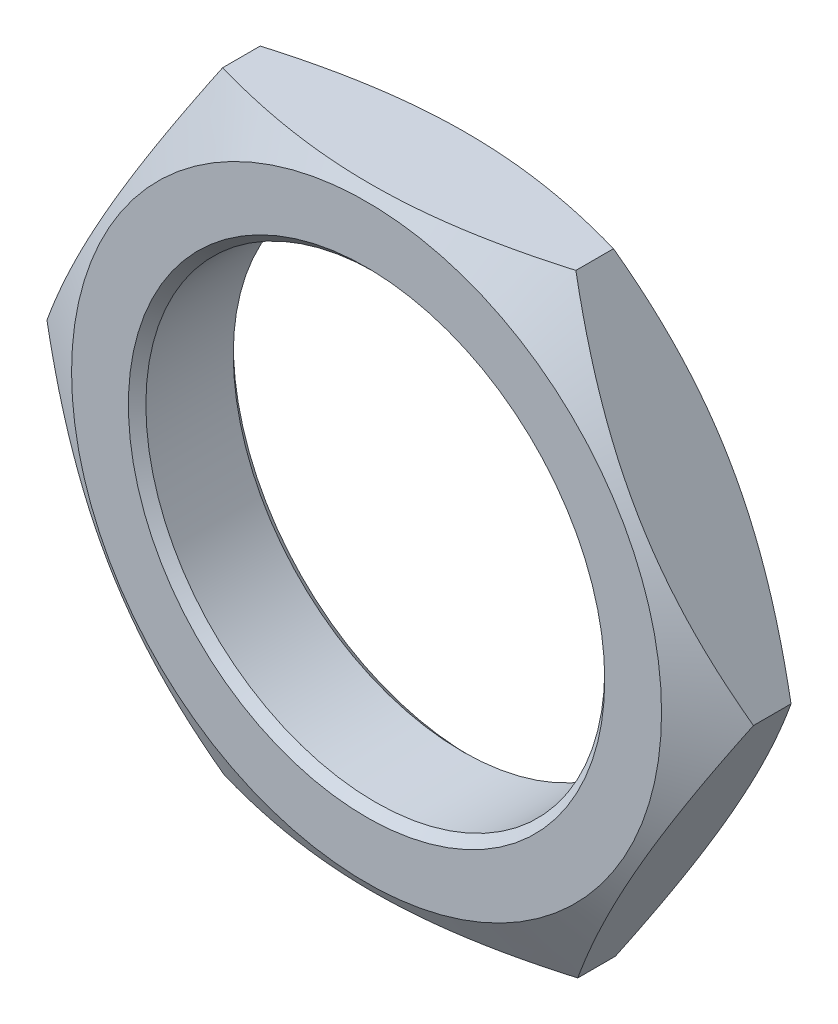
ISO-10303-21;
HEADER;
FILE_DESCRIPTION(('STEP AP214'),'2;1');
FILE_NAME('part.step','',(''),(''),'','','');
FILE_SCHEMA(('AUTOMOTIVE_DESIGN { 1 0 10303 214 1 1 1 1 }'));
ENDSEC;
DATA;
#1=APPLICATION_CONTEXT('core data for automotive mechanical design processes');
#2=APPLICATION_PROTOCOL_DEFINITION('international standard','automotive_design',2000,#1);
#3=PRODUCT_CONTEXT('',#1,'mechanical');
#4=PRODUCT('Part','Part','',(#3));
#5=PRODUCT_RELATED_PRODUCT_CATEGORY('part','',(#4));
#6=PRODUCT_DEFINITION_FORMATION('','',#4);
#7=PRODUCT_DEFINITION_CONTEXT('part definition',#1,'design');
#8=PRODUCT_DEFINITION('design','',#6,#7);
#9=PRODUCT_DEFINITION_SHAPE('','',#8);
#10=(LENGTH_UNIT() NAMED_UNIT(*) SI_UNIT(.MILLI.,.METRE.));
#11=(NAMED_UNIT(*) PLANE_ANGLE_UNIT() SI_UNIT($,.RADIAN.));
#12=(NAMED_UNIT(*) SI_UNIT($,.STERADIAN.) SOLID_ANGLE_UNIT());
#13=UNCERTAINTY_MEASURE_WITH_UNIT(LENGTH_MEASURE(1.E-05),#10,'distance_accuracy_value','');
#14=(GEOMETRIC_REPRESENTATION_CONTEXT(3) GLOBAL_UNCERTAINTY_ASSIGNED_CONTEXT((#13)) GLOBAL_UNIT_ASSIGNED_CONTEXT((#10,
#11,#12)) REPRESENTATION_CONTEXT('',''));
#15=CARTESIAN_POINT('',(0.,0.,0.));
#16=DIRECTION('',(0.,0.,1.));
#17=DIRECTION('',(1.,0.,0.));
#18=AXIS2_PLACEMENT_3D('',#15,#16,#17);
#19=CARTESIAN_POINT('',(-4.01970905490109,-7.01250828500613,2.4));
#20=DIRECTION('',(-0.00310333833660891,0.99999518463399,0.));
#21=DIRECTION('',(-0.99999518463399,-0.00310333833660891,0.));
#22=AXIS2_PLACEMENT_3D('',#19,#20,#21);
#23=PLANE('',#22);
#24=CARTESIAN_POINT('',(4.06335579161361,-6.98742367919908,0.769610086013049));
#25=CARTESIAN_POINT('',(3.88568555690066,-6.98797505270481,0.718328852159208));
#26=CARTESIAN_POINT('',(3.70735288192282,-6.9885284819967,0.669374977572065));
#27=CARTESIAN_POINT('',(3.34923928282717,-6.98963983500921,0.576762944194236));
#28=CARTESIAN_POINT('',(3.16945776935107,-6.99019776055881,0.533107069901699));
#29=CARTESIAN_POINT('',(2.62723473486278,-6.99188047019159,0.410943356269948));
#30=CARTESIAN_POINT('',(2.26265288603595,-6.99301189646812,0.341458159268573));
#31=CARTESIAN_POINT('',(1.7170627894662,-6.99470505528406,0.259978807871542));
#32=CARTESIAN_POINT('',(1.5376846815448,-6.9952617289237,0.236767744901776));
#33=CARTESIAN_POINT('',(1.17811796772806,-6.99637759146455,0.19784628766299));
#34=CARTESIAN_POINT('',(0.997929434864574,-6.9969367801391,0.1821352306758));
#35=CARTESIAN_POINT('',(0.63723943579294,-6.99805612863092,0.158614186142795));
#36=CARTESIAN_POINT('',(0.456738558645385,-6.99861628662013,0.150795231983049));
#37=CARTESIAN_POINT('',(0.0955800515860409,-6.99973708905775,0.143217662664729));
#38=CARTESIAN_POINT('',(-0.0850775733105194,-7.0002977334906,0.143458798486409));
#39=CARTESIAN_POINT('',(-0.580015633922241,-7.00183370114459,0.155198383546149));
#40=CARTESIAN_POINT('',(-0.894134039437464,-7.00280852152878,0.174904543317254));
#41=CARTESIAN_POINT('',(-1.52028451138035,-7.0047516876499,0.237391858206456));
#42=CARTESIAN_POINT('',(-1.83231437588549,-7.00572002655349,0.280194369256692));
#43=CARTESIAN_POINT('',(-2.4597248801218,-7.00766710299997,0.387187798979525));
#44=CARTESIAN_POINT('',(-2.77502635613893,-7.00864559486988,0.451832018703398));
#45=CARTESIAN_POINT('',(-3.40092738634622,-7.01058798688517,0.598548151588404));
#46=CARTESIAN_POINT('',(-3.71153495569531,-7.01155191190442,0.680585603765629));
#47=CARTESIAN_POINT('',(-4.01990905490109,-7.01250890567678,0.769610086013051));
#48=B_SPLINE_CURVE_WITH_KNOTS('',3,(#24,#25,#26,#27,#28,#29,#30,#31,#32,#33,#34,#35,#36,#37,#38,
#39,#40,#41,#42,#43,#44,#45,#46,#47),.UNSPECIFIED.,.F.,.F.,(4,2,2,2,2,2,2,2,2,2,2,4),(0.,
0.554726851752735,1.10969205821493,2.22192844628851,2.76442515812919,3.30687392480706,
3.8487056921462,4.39052071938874,5.3337433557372,6.27783963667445,7.24287417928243,
8.20601428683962),.UNSPECIFIED.);
#49=CARTESIAN_POINT('',(4.06315579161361,-6.98742429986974,0.769552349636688));
#50=VERTEX_POINT('',#49);
#51=CARTESIAN_POINT('',(-4.01970905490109,-7.01250828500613,0.76955234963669));
#52=VERTEX_POINT('',#51);
#53=EDGE_CURVE('E50',#50,#52,#48,.T.);
#54=ORIENTED_EDGE('',*,*,#53,.F.);
#55=DIRECTION('',(0.,0.,-1.));
#56=VECTOR('',#55,1.);
#57=CARTESIAN_POINT('',(4.06315579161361,-6.98742429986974,2.4));
#58=LINE('',#57,#56);
#59=CARTESIAN_POINT('',(4.06315579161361,-6.98742429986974,1.63044765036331));
#60=VERTEX_POINT('',#59);
#61=EDGE_CURVE('E120',#60,#50,#58,.T.);
#62=ORIENTED_EDGE('',*,*,#61,.F.);
#63=CARTESIAN_POINT('',(-4.01990905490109,-7.01250890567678,1.63038991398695));
#64=CARTESIAN_POINT('',(-3.84223882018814,-7.01195753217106,1.68167114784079));
#65=CARTESIAN_POINT('',(-3.6639061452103,-7.01140410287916,1.73062502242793));
#66=CARTESIAN_POINT('',(-3.30579254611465,-7.01029274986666,1.82323705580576));
#67=CARTESIAN_POINT('',(-3.12601103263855,-7.00973482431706,1.8668929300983));
#68=CARTESIAN_POINT('',(-2.58378799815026,-7.00805211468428,1.98905664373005));
#69=CARTESIAN_POINT('',(-2.21920614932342,-7.00692068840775,2.05854184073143));
#70=CARTESIAN_POINT('',(-1.67361605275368,-7.00522752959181,2.14002119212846));
#71=CARTESIAN_POINT('',(-1.49423794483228,-7.00467085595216,2.16323225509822));
#72=CARTESIAN_POINT('',(-1.13467123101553,-7.00355499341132,2.20215371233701));
#73=CARTESIAN_POINT('',(-0.954482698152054,-7.00299580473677,2.2178647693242));
#74=CARTESIAN_POINT('',(-0.593792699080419,-7.00187645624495,2.2413858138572));
#75=CARTESIAN_POINT('',(-0.413291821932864,-7.00131629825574,2.24920476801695));
#76=CARTESIAN_POINT('',(-0.0521333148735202,-7.00019549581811,2.25678233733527));
#77=CARTESIAN_POINT('',(0.12852431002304,-6.99963485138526,2.25654120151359));
#78=CARTESIAN_POINT('',(0.623462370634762,-6.99809888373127,2.24480161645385));
#79=CARTESIAN_POINT('',(0.937580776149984,-6.99712406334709,2.22509545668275));
#80=CARTESIAN_POINT('',(1.56373124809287,-6.99518089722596,2.16260814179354));
#81=CARTESIAN_POINT('',(1.87576111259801,-6.99421255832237,2.11980563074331));
#82=CARTESIAN_POINT('',(2.50317161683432,-6.9922654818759,2.01281220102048));
#83=CARTESIAN_POINT('',(2.81847309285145,-6.99128699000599,1.9481679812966));
#84=CARTESIAN_POINT('',(3.44437412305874,-6.98934459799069,1.8014518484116));
#85=CARTESIAN_POINT('',(3.75498169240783,-6.98838067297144,1.71941439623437));
#86=CARTESIAN_POINT('',(4.06335579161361,-6.98742367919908,1.63038991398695));
#87=B_SPLINE_CURVE_WITH_KNOTS('',3,(#63,#64,#65,#66,#67,#68,#69,#70,#71,#72,#73,#74,#75,#76,#77,
#78,#79,#80,#81,#82,#83,#84,#85,#86),.UNSPECIFIED.,.F.,.F.,(4,2,2,2,2,2,2,2,2,2,2,4),(0.,
0.554726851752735,1.10969205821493,2.22192844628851,2.76442515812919,3.30687392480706,
3.8487056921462,4.39052071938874,5.3337433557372,6.27783963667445,7.24287417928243,
8.20601428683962),.UNSPECIFIED.);
#88=CARTESIAN_POINT('',(-4.01970905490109,-7.01250828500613,1.63044765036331));
#89=VERTEX_POINT('',#88);
#90=EDGE_CURVE('E111',#89,#60,#87,.T.);
#91=ORIENTED_EDGE('',*,*,#90,.F.);
#92=DIRECTION('',(0.,0.,-1.));
#93=VECTOR('',#92,1.);
#94=CARTESIAN_POINT('',(-4.01970905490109,-7.01250828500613,2.4));
#95=LINE('',#94,#93);
#96=EDGE_CURVE('E107',#89,#52,#95,.T.);
#97=ORIENTED_EDGE('',*,*,#96,.T.);
#98=EDGE_LOOP('',(#54,#62,#91,#97));
#99=FACE_BOUND('',#98,.T.);
#100=ADVANCED_FACE('F35',(#99),#23,.F.);
#101=CARTESIAN_POINT('',(4.06315579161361,-6.98742429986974,2.4));
#102=DIRECTION('',(-0.86757290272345,0.497310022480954,0.));
#103=DIRECTION('',(-0.497310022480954,-0.86757290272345,0.));
#104=AXIS2_PLACEMENT_3D('',#101,#102,#103);
#105=PLANE('',#104);
#106=CARTESIAN_POINT('',(8.08297949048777,0.025283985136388,0.769618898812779));
#107=CARTESIAN_POINT('',(7.99462174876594,-0.128858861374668,0.718337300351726));
#108=CARTESIAN_POINT('',(7.90593456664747,-0.283576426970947,0.669383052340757));
#109=CARTESIAN_POINT('',(7.72783996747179,-0.5942680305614,0.576770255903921));
#110=CARTESIAN_POINT('',(7.63843225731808,-0.750242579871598,0.533113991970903));
#111=CARTESIAN_POINT('',(7.36877760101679,-1.22066356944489,0.410949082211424));
#112=CARTESIAN_POINT('',(7.18746623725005,-1.53696691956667,0.341463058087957));
#113=CARTESIAN_POINT('',(6.91613708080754,-2.01030912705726,0.259982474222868));
#114=CARTESIAN_POINT('',(6.82692998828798,-2.16593369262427,0.236771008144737));
#115=CARTESIAN_POINT('',(6.64811272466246,-2.47788600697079,0.19784874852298));
#116=CARTESIAN_POINT('',(6.55850258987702,-2.63421369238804,0.182137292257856));
#117=CARTESIAN_POINT('',(6.37912668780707,-2.94714056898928,0.158615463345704));
#118=CARTESIAN_POINT('',(6.28936121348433,-3.10373924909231,0.150796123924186));
#119=CARTESIAN_POINT('',(6.10975230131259,-3.41707261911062,0.143217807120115));
#120=CARTESIAN_POINT('',(6.01990886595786,-3.57380730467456,0.143458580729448));
#121=CARTESIAN_POINT('',(5.77376761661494,-4.00320841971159,0.155197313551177));
#122=CARTESIAN_POINT('',(5.61755037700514,-4.27573428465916,0.174903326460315));
#123=CARTESIAN_POINT('',(5.30615347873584,-4.81897592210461,0.237391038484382));
#124=CARTESIAN_POINT('',(5.15097491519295,-5.08968978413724,0.280194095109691));
#125=CARTESIAN_POINT('',(4.83895134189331,-5.63402467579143,0.38718922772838));
#126=CARTESIAN_POINT('',(4.68214570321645,-5.90757702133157,0.451834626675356));
#127=CARTESIAN_POINT('',(4.37087282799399,-6.45060229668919,0.598553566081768));
#128=CARTESIAN_POINT('',(4.21640160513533,-6.7200821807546,0.680592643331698));
#129=CARTESIAN_POINT('',(4.06304114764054,-6.98762429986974,0.769618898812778));
#130=B_SPLINE_CURVE_WITH_KNOTS('',3,(#106,#107,#108,#109,#110,#111,#112,#113,#114,#115,#116,
#117,#118,#119,#120,#121,#122,#123,#124,#125,#126,#127,#128,#129),.UNSPECIFIED.,.F.,.F.,(4,2,2,
2,2,2,2,2,2,2,2,4),(0.,0.554727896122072,1.10969414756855,2.22193268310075,2.76443034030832,
3.30688005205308,3.84871275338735,4.39052871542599,5.33376486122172,6.27787470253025,
7.24292352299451,8.20607780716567),.UNSPECIFIED.);
#131=CARTESIAN_POINT('',(8.0828648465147,0.0250839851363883,0.76955234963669));
#132=VERTEX_POINT('',#131);
#133=EDGE_CURVE('E184',#132,#50,#130,.T.);
#134=ORIENTED_EDGE('',*,*,#133,.F.);
#135=DIRECTION('',(0.,0.,-1.));
#136=VECTOR('',#135,1.);
#137=CARTESIAN_POINT('',(8.0828648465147,0.0250839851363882,2.4));
#138=LINE('',#137,#136);
#139=CARTESIAN_POINT('',(8.0828648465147,0.0250839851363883,1.63044765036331));
#140=VERTEX_POINT('',#139);
#141=EDGE_CURVE('E117',#140,#132,#138,.T.);
#142=ORIENTED_EDGE('',*,*,#141,.F.);
#143=CARTESIAN_POINT('',(4.06304114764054,-6.98762429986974,1.63038110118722));
#144=CARTESIAN_POINT('',(4.15139888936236,-6.83348145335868,1.68166269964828));
#145=CARTESIAN_POINT('',(4.24008607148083,-6.6787638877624,1.73061694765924));
#146=CARTESIAN_POINT('',(4.41818067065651,-6.36807228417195,1.82322974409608));
#147=CARTESIAN_POINT('',(4.50758838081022,-6.21209773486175,1.8668860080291));
#148=CARTESIAN_POINT('',(4.77724303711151,-5.74167674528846,1.98905091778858));
#149=CARTESIAN_POINT('',(4.95855440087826,-5.42537339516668,2.05853694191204));
#150=CARTESIAN_POINT('',(5.22988355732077,-4.95203118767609,2.14001752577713));
#151=CARTESIAN_POINT('',(5.31909064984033,-4.79640662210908,2.16322899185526));
#152=CARTESIAN_POINT('',(5.49790791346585,-4.48445430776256,2.20215125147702));
#153=CARTESIAN_POINT('',(5.58751804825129,-4.32812662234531,2.21786270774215));
#154=CARTESIAN_POINT('',(5.76689395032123,-4.01519974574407,2.2413845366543));
#155=CARTESIAN_POINT('',(5.85665942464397,-3.85860106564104,2.24920387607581));
#156=CARTESIAN_POINT('',(6.03626833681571,-3.54526769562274,2.25678219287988));
#157=CARTESIAN_POINT('',(6.12611177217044,-3.38853301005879,2.25654141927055));
#158=CARTESIAN_POINT('',(6.37225302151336,-2.95913189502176,2.24480268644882));
#159=CARTESIAN_POINT('',(6.52847026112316,-2.68660603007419,2.22509667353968));
#160=CARTESIAN_POINT('',(6.83986715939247,-2.14336439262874,2.16260896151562));
#161=CARTESIAN_POINT('',(6.99504572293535,-1.87265053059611,2.11980590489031));
#162=CARTESIAN_POINT('',(7.30706929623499,-1.32831563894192,2.01281077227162));
#163=CARTESIAN_POINT('',(7.46387493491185,-1.05476329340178,1.94816537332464));
#164=CARTESIAN_POINT('',(7.77514781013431,-0.511738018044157,1.80144643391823));
#165=CARTESIAN_POINT('',(7.92961903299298,-0.24225813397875,1.7194073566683));
#166=CARTESIAN_POINT('',(8.08297949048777,0.0252839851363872,1.63038110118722));
#167=B_SPLINE_CURVE_WITH_KNOTS('',3,(#143,#144,#145,#146,#147,#148,#149,#150,#151,#152,#153,
#154,#155,#156,#157,#158,#159,#160,#161,#162,#163,#164,#165,#166),.UNSPECIFIED.,.F.,.F.,(4,2,2,
2,2,2,2,2,2,2,2,4),(0.,0.554727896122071,1.10969414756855,2.22193268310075,2.76443034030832,
3.30688005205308,3.84871275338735,4.39052871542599,5.33376486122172,6.27787470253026,
7.24292352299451,8.20607780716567),.UNSPECIFIED.);
#168=EDGE_CURVE('E166',#60,#140,#167,.T.);
#169=ORIENTED_EDGE('',*,*,#168,.F.);
#170=ORIENTED_EDGE('',*,*,#61,.T.);
#171=EDGE_LOOP('',(#134,#142,#169,#170));
#172=FACE_BOUND('',#171,.T.);
#173=ADVANCED_FACE('F175',(#172),#105,.F.);
#174=CARTESIAN_POINT('',(8.0828648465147,0.0250839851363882,2.4));
#175=DIRECTION('',(-0.864469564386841,-0.502685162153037,0.));
#176=DIRECTION('',(0.502685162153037,-0.864469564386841,0.));
#177=AXIS2_PLACEMENT_3D('',#174,#175,#176);
#178=PLANE('',#177);
#179=CARTESIAN_POINT('',(4.01959275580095,7.01270828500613,0.769619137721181));
#180=CARTESIAN_POINT('',(4.10890550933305,6.85911680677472,0.718337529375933));
#181=CARTESIAN_POINT('',(4.19855126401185,6.70495266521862,0.669383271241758));
#182=CARTESIAN_POINT('',(4.37857079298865,6.39537240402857,0.576770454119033));
#183=CARTESIAN_POINT('',(4.4689448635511,6.23995577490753,0.53311417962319));
#184=CARTESIAN_POINT('',(4.74151407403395,5.77121747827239,0.410949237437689));
#185=CARTESIAN_POINT('',(4.92478513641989,5.45604554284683,0.341463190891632));
#186=CARTESIAN_POINT('',(5.19904694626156,4.984396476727,0.259982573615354));
#187=CARTESIAN_POINT('',(5.2892182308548,4.82932857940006,0.236771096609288));
#188=CARTESIAN_POINT('',(5.46996823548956,4.51849211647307,0.197848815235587));
#189=CARTESIAN_POINT('',(5.56054691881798,4.36272361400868,0.182137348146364));
#190=CARTESIAN_POINT('',(5.74186160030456,4.05091607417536,0.15861549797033));
#191=CARTESIAN_POINT('',(5.83259730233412,3.89487754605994,0.150796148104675));
#192=CARTESIAN_POINT('',(6.01414751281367,3.5826649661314,0.143217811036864));
#193=CARTESIAN_POINT('',(6.10496201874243,3.42649091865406,0.143458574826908));
#194=CARTESIAN_POINT('',(6.35376373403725,2.9986256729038,0.155197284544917));
#195=CARTESIAN_POINT('',(6.51166949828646,2.72707453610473,0.174903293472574));
#196=CARTESIAN_POINT('',(6.82643223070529,2.18577588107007,0.237391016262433));
#197=CARTESIAN_POINT('',(6.98328809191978,1.91603026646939,0.280194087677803));
#198=CARTESIAN_POINT('',(7.29868427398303,1.37364226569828,0.387189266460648));
#199=CARTESIAN_POINT('',(7.45718479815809,1.10106831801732,0.451834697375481));
#200=CARTESIAN_POINT('',(7.77182216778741,0.559985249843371,0.598553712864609));
#201=CARTESIAN_POINT('',(7.92796304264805,0.291469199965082,0.680592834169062));
#202=CARTESIAN_POINT('',(8.08298114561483,0.0248839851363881,0.769619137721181));
#203=B_SPLINE_CURVE_WITH_KNOTS('',3,(#179,#180,#181,#182,#183,#184,#185,#186,#187,#188,#189,
#190,#191,#192,#193,#194,#195,#196,#197,#198,#199,#200,#201,#202),.UNSPECIFIED.,.F.,.F.,(4,2,2,
2,2,2,2,2,2,2,2,4),(0.,0.554727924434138,1.10969420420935,2.22193279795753,2.7644304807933,
3.30688021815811,3.8487129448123,4.39052893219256,5.33376544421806,6.2778756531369,
7.24292486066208,8.20607952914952),.UNSPECIFIED.);
#204=CARTESIAN_POINT('',(4.01970905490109,7.01250828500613,0.769552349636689));
#205=VERTEX_POINT('',#204);
#206=EDGE_CURVE('E190',#205,#132,#203,.T.);
#207=ORIENTED_EDGE('',*,*,#206,.F.);
#208=DIRECTION('',(0.,0.,-1.));
#209=VECTOR('',#208,1.);
#210=CARTESIAN_POINT('',(4.01970905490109,7.01250828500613,2.4));
#211=LINE('',#210,#209);
#212=CARTESIAN_POINT('',(4.01970905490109,7.01250828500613,1.63044765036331));
#213=VERTEX_POINT('',#212);
#214=EDGE_CURVE('E109',#213,#205,#211,.T.);
#215=ORIENTED_EDGE('',*,*,#214,.F.);
#216=CARTESIAN_POINT('',(8.08298114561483,0.0248839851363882,1.63038086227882));
#217=CARTESIAN_POINT('',(7.99366839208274,0.178475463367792,1.68166247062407));
#218=CARTESIAN_POINT('',(7.90402263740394,0.332639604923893,1.73061672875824));
#219=CARTESIAN_POINT('',(7.72400310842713,0.642219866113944,1.82322954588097));
#220=CARTESIAN_POINT('',(7.63362903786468,0.797636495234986,1.86688582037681));
#221=CARTESIAN_POINT('',(7.36105982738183,1.26637479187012,1.98905076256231));
#222=CARTESIAN_POINT('',(7.1777887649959,1.58154672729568,2.05853680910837));
#223=CARTESIAN_POINT('',(6.90352695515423,2.05319579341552,2.14001742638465));
#224=CARTESIAN_POINT('',(6.81335567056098,2.20826369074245,2.16322890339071));
#225=CARTESIAN_POINT('',(6.63260566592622,2.51910015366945,2.20215118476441));
#226=CARTESIAN_POINT('',(6.54202698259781,2.67486865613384,2.21786265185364));
#227=CARTESIAN_POINT('',(6.36071230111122,2.98667619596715,2.24138450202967));
#228=CARTESIAN_POINT('',(6.26997659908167,3.14271472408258,2.24920385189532));
#229=CARTESIAN_POINT('',(6.08842638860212,3.45492730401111,2.25678218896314));
#230=CARTESIAN_POINT('',(5.99761188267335,3.61110135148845,2.25654142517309));
#231=CARTESIAN_POINT('',(5.74881016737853,4.03896659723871,2.24480271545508));
#232=CARTESIAN_POINT('',(5.59090440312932,4.31051773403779,2.22509670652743));
#233=CARTESIAN_POINT('',(5.27614167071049,4.85181638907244,2.16260898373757));
#234=CARTESIAN_POINT('',(5.119285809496,5.12156200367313,2.1198059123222));
#235=CARTESIAN_POINT('',(4.80388962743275,5.66395000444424,2.01281073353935));
#236=CARTESIAN_POINT('',(4.6453891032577,5.9365239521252,1.94816530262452));
#237=CARTESIAN_POINT('',(4.33075173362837,6.47760702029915,1.80144628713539));
#238=CARTESIAN_POINT('',(4.17461085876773,6.74612307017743,1.71940716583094));
#239=CARTESIAN_POINT('',(4.01959275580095,7.01270828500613,1.63038086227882));
#240=B_SPLINE_CURVE_WITH_KNOTS('',3,(#216,#217,#218,#219,#220,#221,#222,#223,#224,#225,#226,
#227,#228,#229,#230,#231,#232,#233,#234,#235,#236,#237,#238,#239),.UNSPECIFIED.,.F.,.F.,(4,2,2,
2,2,2,2,2,2,2,2,4),(0.,0.554727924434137,1.10969420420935,2.22193279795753,2.76443048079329,
3.30688021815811,3.8487129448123,4.39052893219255,5.33376544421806,6.2778756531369,
7.24292486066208,8.20607952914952),.UNSPECIFIED.);
#241=EDGE_CURVE('E160',#140,#213,#240,.T.);
#242=ORIENTED_EDGE('',*,*,#241,.F.);
#243=ORIENTED_EDGE('',*,*,#141,.T.);
#244=EDGE_LOOP('',(#207,#215,#242,#243));
#245=FACE_BOUND('',#244,.T.);
#246=ADVANCED_FACE('F178',(#245),#178,.F.);
#247=CARTESIAN_POINT('',(4.01970905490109,7.01250828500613,2.4));
#248=DIRECTION('',(0.00310333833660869,-0.99999518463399,0.));
#249=DIRECTION('',(0.99999518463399,0.00310333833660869,0.));
#250=AXIS2_PLACEMENT_3D('',#247,#248,#249);
#251=PLANE('',#250);
#252=CARTESIAN_POINT('',(-4.06335579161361,6.98742367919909,0.769610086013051));
#253=CARTESIAN_POINT('',(-3.88568555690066,6.98797505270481,0.71832885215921));
#254=CARTESIAN_POINT('',(-3.70735288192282,6.9885284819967,0.669374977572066));
#255=CARTESIAN_POINT('',(-3.34923928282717,6.98963983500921,0.576762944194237));
#256=CARTESIAN_POINT('',(-3.16945776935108,6.99019776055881,0.5331070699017));
#257=CARTESIAN_POINT('',(-2.62723473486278,6.99188047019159,0.410943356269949));
#258=CARTESIAN_POINT('',(-2.26265288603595,6.99301189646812,0.341458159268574));
#259=CARTESIAN_POINT('',(-1.7170627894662,6.99470505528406,0.259978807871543));
#260=CARTESIAN_POINT('',(-1.5376846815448,6.99526172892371,0.236767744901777));
#261=CARTESIAN_POINT('',(-1.17811796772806,6.99637759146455,0.197846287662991));
#262=CARTESIAN_POINT('',(-0.997929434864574,6.9969367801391,0.182135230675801));
#263=CARTESIAN_POINT('',(-0.637239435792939,6.99805612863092,0.158614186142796));
#264=CARTESIAN_POINT('',(-0.456738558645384,6.99861628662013,0.150795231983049));
#265=CARTESIAN_POINT('',(-0.0955800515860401,6.99973708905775,0.14321766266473));
#266=CARTESIAN_POINT('',(0.0850775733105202,7.0002977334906,0.14345879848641));
#267=CARTESIAN_POINT('',(0.580015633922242,7.00183370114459,0.15519838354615));
#268=CARTESIAN_POINT('',(0.894134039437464,7.00280852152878,0.174904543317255));
#269=CARTESIAN_POINT('',(1.52028451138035,7.0047516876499,0.237391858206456));
#270=CARTESIAN_POINT('',(1.83231437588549,7.00572002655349,0.280194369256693));
#271=CARTESIAN_POINT('',(2.4597248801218,7.00766710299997,0.387187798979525));
#272=CARTESIAN_POINT('',(2.77502635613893,7.00864559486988,0.451832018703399));
#273=CARTESIAN_POINT('',(3.40092738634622,7.01058798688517,0.598548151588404));
#274=CARTESIAN_POINT('',(3.71153495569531,7.01155191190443,0.680585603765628));
#275=CARTESIAN_POINT('',(4.01990905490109,7.01250890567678,0.769610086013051));
#276=B_SPLINE_CURVE_WITH_KNOTS('',3,(#252,#253,#254,#255,#256,#257,#258,#259,#260,#261,#262,
#263,#264,#265,#266,#267,#268,#269,#270,#271,#272,#273,#274,#275),.UNSPECIFIED.,.F.,.F.,(4,2,2,
2,2,2,2,2,2,2,2,4),(0.,0.554726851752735,1.10969205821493,2.22192844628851,2.76442515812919,
3.30687392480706,3.84870569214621,4.39052071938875,5.3337433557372,6.27783963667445,
7.24287417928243,8.20601428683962),.UNSPECIFIED.);
#277=CARTESIAN_POINT('',(-4.06315579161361,6.98742429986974,0.76955234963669));
#278=VERTEX_POINT('',#277);
#279=EDGE_CURVE('E103',#278,#205,#276,.T.);
#280=ORIENTED_EDGE('',*,*,#279,.F.);
#281=DIRECTION('',(0.,0.,-1.));
#282=VECTOR('',#281,1.);
#283=CARTESIAN_POINT('',(-4.06315579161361,6.98742429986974,2.4));
#284=LINE('',#283,#282);
#285=CARTESIAN_POINT('',(-4.06315579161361,6.98742429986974,1.63044765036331));
#286=VERTEX_POINT('',#285);
#287=EDGE_CURVE('E102',#286,#278,#284,.T.);
#288=ORIENTED_EDGE('',*,*,#287,.F.);
#289=CARTESIAN_POINT('',(4.01990905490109,7.01250890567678,1.63038991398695));
#290=CARTESIAN_POINT('',(3.84223882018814,7.01195753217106,1.68167114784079));
#291=CARTESIAN_POINT('',(3.6639061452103,7.01140410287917,1.73062502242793));
#292=CARTESIAN_POINT('',(3.30579254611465,7.01029274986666,1.82323705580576));
#293=CARTESIAN_POINT('',(3.12601103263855,7.00973482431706,1.8668929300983));
#294=CARTESIAN_POINT('',(2.58378799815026,7.00805211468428,1.98905664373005));
#295=CARTESIAN_POINT('',(2.21920614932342,7.00692068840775,2.05854184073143));
#296=CARTESIAN_POINT('',(1.67361605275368,7.00522752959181,2.14002119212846));
#297=CARTESIAN_POINT('',(1.49423794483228,7.00467085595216,2.16323225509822));
#298=CARTESIAN_POINT('',(1.13467123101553,7.00355499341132,2.20215371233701));
#299=CARTESIAN_POINT('',(0.954482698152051,7.00299580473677,2.2178647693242));
#300=CARTESIAN_POINT('',(0.593792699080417,7.00187645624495,2.2413858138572));
#301=CARTESIAN_POINT('',(0.413291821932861,7.00131629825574,2.24920476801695));
#302=CARTESIAN_POINT('',(0.0521333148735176,7.00019549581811,2.25678233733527));
#303=CARTESIAN_POINT('',(-0.128524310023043,6.99963485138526,2.25654120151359));
#304=CARTESIAN_POINT('',(-0.623462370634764,6.99809888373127,2.24480161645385));
#305=CARTESIAN_POINT('',(-0.937580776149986,6.99712406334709,2.22509545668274));
#306=CARTESIAN_POINT('',(-1.56373124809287,6.99518089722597,2.16260814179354));
#307=CARTESIAN_POINT('',(-1.87576111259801,6.99421255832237,2.11980563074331));
#308=CARTESIAN_POINT('',(-2.50317161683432,6.9922654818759,2.01281220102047));
#309=CARTESIAN_POINT('',(-2.81847309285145,6.99128699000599,1.9481679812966));
#310=CARTESIAN_POINT('',(-3.44437412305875,6.9893445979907,1.80145184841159));
#311=CARTESIAN_POINT('',(-3.75498169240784,6.98838067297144,1.71941439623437));
#312=CARTESIAN_POINT('',(-4.06335579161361,6.98742367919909,1.63038991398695));
#313=B_SPLINE_CURVE_WITH_KNOTS('',3,(#289,#290,#291,#292,#293,#294,#295,#296,#297,#298,#299,
#300,#301,#302,#303,#304,#305,#306,#307,#308,#309,#310,#311,#312),.UNSPECIFIED.,.F.,.F.,(4,2,2,
2,2,2,2,2,2,2,2,4),(0.,0.554726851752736,1.10969205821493,2.22192844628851,2.76442515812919,
3.30687392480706,3.84870569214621,4.39052071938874,5.3337433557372,6.27783963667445,
7.24287417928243,8.20601428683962),.UNSPECIFIED.);
#314=EDGE_CURVE('E154',#213,#286,#313,.T.);
#315=ORIENTED_EDGE('',*,*,#314,.F.);
#316=ORIENTED_EDGE('',*,*,#214,.T.);
#317=EDGE_LOOP('',(#280,#288,#315,#316));
#318=FACE_BOUND('',#317,.T.);
#319=ADVANCED_FACE('F209',(#318),#251,.F.);
#320=CARTESIAN_POINT('',(-4.06315579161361,6.98742429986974,2.4));
#321=DIRECTION('',(0.86757290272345,-0.497310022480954,0.));
#322=DIRECTION('',(0.497310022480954,0.86757290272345,0.));
#323=AXIS2_PLACEMENT_3D('',#320,#321,#322);
#324=PLANE('',#323);
#325=CARTESIAN_POINT('',(-8.08297949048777,-0.0252839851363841,0.76961889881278));
#326=CARTESIAN_POINT('',(-7.99462174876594,0.128858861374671,0.718337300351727));
#327=CARTESIAN_POINT('',(-7.90593456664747,0.28357642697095,0.669383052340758));
#328=CARTESIAN_POINT('',(-7.7278399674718,0.594268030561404,0.576770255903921));
#329=CARTESIAN_POINT('',(-7.63843225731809,0.750242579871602,0.533113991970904));
#330=CARTESIAN_POINT('',(-7.3687776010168,1.22066356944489,0.410949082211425));
#331=CARTESIAN_POINT('',(-7.18746623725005,1.53696691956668,0.341463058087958));
#332=CARTESIAN_POINT('',(-6.91613708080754,2.01030912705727,0.25998247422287));
#333=CARTESIAN_POINT('',(-6.82692998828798,2.16593369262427,0.236771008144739));
#334=CARTESIAN_POINT('',(-6.64811272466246,2.4778860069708,0.197848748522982));
#335=CARTESIAN_POINT('',(-6.55850258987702,2.63421369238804,0.182137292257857));
#336=CARTESIAN_POINT('',(-6.37912668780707,2.94714056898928,0.158615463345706));
#337=CARTESIAN_POINT('',(-6.28936121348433,3.10373924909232,0.150796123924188));
#338=CARTESIAN_POINT('',(-6.10975230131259,3.41707261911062,0.143217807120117));
#339=CARTESIAN_POINT('',(-6.01990886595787,3.57380730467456,0.14345858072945));
#340=CARTESIAN_POINT('',(-5.77376761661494,4.0032084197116,0.155197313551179));
#341=CARTESIAN_POINT('',(-5.61755037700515,4.27573428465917,0.174903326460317));
#342=CARTESIAN_POINT('',(-5.30615347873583,4.81897592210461,0.237391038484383));
#343=CARTESIAN_POINT('',(-5.15097491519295,5.08968978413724,0.280194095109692));
#344=CARTESIAN_POINT('',(-4.83895134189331,5.63402467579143,0.387189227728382));
#345=CARTESIAN_POINT('',(-4.68214570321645,5.90757702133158,0.451834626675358));
#346=CARTESIAN_POINT('',(-4.37087282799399,6.4506022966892,0.598553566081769));
#347=CARTESIAN_POINT('',(-4.21640160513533,6.7200821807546,0.6805926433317));
#348=CARTESIAN_POINT('',(-4.06304114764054,6.98762429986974,0.769618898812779));
#349=B_SPLINE_CURVE_WITH_KNOTS('',3,(#325,#326,#327,#328,#329,#330,#331,#332,#333,#334,#335,
#336,#337,#338,#339,#340,#341,#342,#343,#344,#345,#346,#347,#348),.UNSPECIFIED.,.F.,.F.,(4,2,2,
2,2,2,2,2,2,2,2,4),(0.,0.554727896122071,1.10969414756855,2.22193268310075,2.76443034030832,
3.30688005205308,3.84871275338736,4.39052871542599,5.33376486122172,6.27787470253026,
7.24292352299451,8.20607780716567),.UNSPECIFIED.);
#350=CARTESIAN_POINT('',(-8.0828648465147,-0.0250839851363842,0.769552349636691));
#351=VERTEX_POINT('',#350);
#352=EDGE_CURVE('E88',#351,#278,#349,.T.);
#353=ORIENTED_EDGE('',*,*,#352,.F.);
#354=DIRECTION('',(0.,0.,-1.));
#355=VECTOR('',#354,1.);
#356=CARTESIAN_POINT('',(-8.0828648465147,-0.0250839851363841,2.4));
#357=LINE('',#356,#355);
#358=CARTESIAN_POINT('',(-8.0828648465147,-0.0250839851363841,1.63044765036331));
#359=VERTEX_POINT('',#358);
#360=EDGE_CURVE('E100',#359,#351,#357,.T.);
#361=ORIENTED_EDGE('',*,*,#360,.F.);
#362=CARTESIAN_POINT('',(-4.06304114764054,6.98762429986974,1.63038110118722));
#363=CARTESIAN_POINT('',(-4.15139888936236,6.83348145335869,1.68166269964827));
#364=CARTESIAN_POINT('',(-4.24008607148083,6.67876388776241,1.73061694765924));
#365=CARTESIAN_POINT('',(-4.41818067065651,6.36807228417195,1.82322974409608));
#366=CARTESIAN_POINT('',(-4.50758838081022,6.21209773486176,1.8668860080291));
#367=CARTESIAN_POINT('',(-4.77724303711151,5.74167674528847,1.98905091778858));
#368=CARTESIAN_POINT('',(-4.95855440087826,5.42537339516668,2.05853694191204));
#369=CARTESIAN_POINT('',(-5.22988355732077,4.95203118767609,2.14001752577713));
#370=CARTESIAN_POINT('',(-5.31909064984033,4.79640662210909,2.16322899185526));
#371=CARTESIAN_POINT('',(-5.49790791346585,4.48445430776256,2.20215125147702));
#372=CARTESIAN_POINT('',(-5.58751804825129,4.32812662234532,2.21786270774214));
#373=CARTESIAN_POINT('',(-5.76689395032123,4.01519974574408,2.24138453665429));
#374=CARTESIAN_POINT('',(-5.85665942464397,3.85860106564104,2.24920387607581));
#375=CARTESIAN_POINT('',(-6.03626833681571,3.54526769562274,2.25678219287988));
#376=CARTESIAN_POINT('',(-6.12611177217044,3.3885330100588,2.25654141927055));
#377=CARTESIAN_POINT('',(-6.37225302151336,2.95913189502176,2.24480268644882));
#378=CARTESIAN_POINT('',(-6.52847026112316,2.68660603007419,2.22509667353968));
#379=CARTESIAN_POINT('',(-6.83986715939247,2.14336439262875,2.16260896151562));
#380=CARTESIAN_POINT('',(-6.99504572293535,1.87265053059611,2.11980590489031));
#381=CARTESIAN_POINT('',(-7.30706929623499,1.32831563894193,2.01281077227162));
#382=CARTESIAN_POINT('',(-7.46387493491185,1.05476329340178,1.94816537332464));
#383=CARTESIAN_POINT('',(-7.77514781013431,0.511738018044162,1.80144643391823));
#384=CARTESIAN_POINT('',(-7.92961903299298,0.242258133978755,1.7194073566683));
#385=CARTESIAN_POINT('',(-8.08297949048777,-0.0252839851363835,1.63038110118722));
#386=B_SPLINE_CURVE_WITH_KNOTS('',3,(#362,#363,#364,#365,#366,#367,#368,#369,#370,#371,#372,
#373,#374,#375,#376,#377,#378,#379,#380,#381,#382,#383,#384,#385),.UNSPECIFIED.,.F.,.F.,(4,2,2,
2,2,2,2,2,2,2,2,4),(0.,0.554727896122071,1.10969414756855,2.22193268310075,2.76443034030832,
3.30688005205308,3.84871275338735,4.39052871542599,5.33376486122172,6.27787470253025,
7.24292352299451,8.20607780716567),.UNSPECIFIED.);
#387=EDGE_CURVE('E58',#286,#359,#386,.T.);
#388=ORIENTED_EDGE('',*,*,#387,.F.);
#389=ORIENTED_EDGE('',*,*,#287,.T.);
#390=EDGE_LOOP('',(#353,#361,#388,#389));
#391=FACE_BOUND('',#390,.T.);
#392=ADVANCED_FACE('F99',(#391),#324,.F.);
#393=CARTESIAN_POINT('',(-8.0828648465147,-0.0250839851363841,2.4));
#394=DIRECTION('',(0.864469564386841,0.502685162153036,0.));
#395=DIRECTION('',(-0.502685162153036,0.864469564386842,0.));
#396=AXIS2_PLACEMENT_3D('',#393,#394,#395);
#397=PLANE('',#396);
#398=CARTESIAN_POINT('',(-4.01959275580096,-7.01270828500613,0.769619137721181));
#399=CARTESIAN_POINT('',(-4.10890550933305,-6.85911680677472,0.718337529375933));
#400=CARTESIAN_POINT('',(-4.19855126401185,-6.70495266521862,0.669383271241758));
#401=CARTESIAN_POINT('',(-4.37857079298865,-6.39537240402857,0.576770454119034));
#402=CARTESIAN_POINT('',(-4.4689448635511,-6.23995577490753,0.533114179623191));
#403=CARTESIAN_POINT('',(-4.74151407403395,-5.77121747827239,0.410949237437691));
#404=CARTESIAN_POINT('',(-4.92478513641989,-5.45604554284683,0.341463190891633));
#405=CARTESIAN_POINT('',(-5.19904694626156,-4.984396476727,0.259982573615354));
#406=CARTESIAN_POINT('',(-5.2892182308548,-4.82932857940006,0.236771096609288));
#407=CARTESIAN_POINT('',(-5.46996823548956,-4.51849211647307,0.197848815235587));
#408=CARTESIAN_POINT('',(-5.56054691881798,-4.36272361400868,0.182137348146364));
#409=CARTESIAN_POINT('',(-5.74186160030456,-4.05091607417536,0.15861549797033));
#410=CARTESIAN_POINT('',(-5.83259730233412,-3.89487754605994,0.150796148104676));
#411=CARTESIAN_POINT('',(-6.01414751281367,-3.5826649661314,0.143217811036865));
#412=CARTESIAN_POINT('',(-6.10496201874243,-3.42649091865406,0.143458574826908));
#413=CARTESIAN_POINT('',(-6.35376373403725,-2.9986256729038,0.155197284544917));
#414=CARTESIAN_POINT('',(-6.51166949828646,-2.72707453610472,0.174903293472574));
#415=CARTESIAN_POINT('',(-6.82643223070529,-2.18577588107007,0.237391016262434));
#416=CARTESIAN_POINT('',(-6.98328809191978,-1.91603026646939,0.280194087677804));
#417=CARTESIAN_POINT('',(-7.29868427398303,-1.37364226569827,0.387189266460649));
#418=CARTESIAN_POINT('',(-7.45718479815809,-1.10106831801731,0.451834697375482));
#419=CARTESIAN_POINT('',(-7.77182216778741,-0.559985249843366,0.598553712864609));
#420=CARTESIAN_POINT('',(-7.92796304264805,-0.291469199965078,0.680592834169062));
#421=CARTESIAN_POINT('',(-8.08298114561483,-0.0248839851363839,0.769619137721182));
#422=B_SPLINE_CURVE_WITH_KNOTS('',3,(#398,#399,#400,#401,#402,#403,#404,#405,#406,#407,#408,
#409,#410,#411,#412,#413,#414,#415,#416,#417,#418,#419,#420,#421),.UNSPECIFIED.,.F.,.F.,(4,2,2,
2,2,2,2,2,2,2,2,4),(0.,0.554727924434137,1.10969420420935,2.22193279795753,2.7644304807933,
3.30688021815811,3.8487129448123,4.39052893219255,5.33376544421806,6.2778756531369,
7.24292486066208,8.20607952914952),.UNSPECIFIED.);
#423=EDGE_CURVE('E85',#52,#351,#422,.T.);
#424=ORIENTED_EDGE('',*,*,#423,.F.);
#425=ORIENTED_EDGE('',*,*,#96,.F.);
#426=CARTESIAN_POINT('',(-8.08298114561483,-0.0248839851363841,1.63038086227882));
#427=CARTESIAN_POINT('',(-7.99366839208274,-0.178475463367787,1.68166247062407));
#428=CARTESIAN_POINT('',(-7.90402263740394,-0.332639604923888,1.73061672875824));
#429=CARTESIAN_POINT('',(-7.72400310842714,-0.64221986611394,1.82322954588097));
#430=CARTESIAN_POINT('',(-7.63362903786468,-0.797636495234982,1.86688582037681));
#431=CARTESIAN_POINT('',(-7.36105982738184,-1.26637479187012,1.98905076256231));
#432=CARTESIAN_POINT('',(-7.1777887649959,-1.58154672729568,2.05853680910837));
#433=CARTESIAN_POINT('',(-6.90352695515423,-2.05319579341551,2.14001742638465));
#434=CARTESIAN_POINT('',(-6.81335567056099,-2.20826369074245,2.16322890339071));
#435=CARTESIAN_POINT('',(-6.63260566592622,-2.51910015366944,2.20215118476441));
#436=CARTESIAN_POINT('',(-6.54202698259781,-2.67486865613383,2.21786265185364));
#437=CARTESIAN_POINT('',(-6.36071230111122,-2.98667619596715,2.24138450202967));
#438=CARTESIAN_POINT('',(-6.26997659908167,-3.14271472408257,2.24920385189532));
#439=CARTESIAN_POINT('',(-6.08842638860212,-3.45492730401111,2.25678218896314));
#440=CARTESIAN_POINT('',(-5.99761188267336,-3.61110135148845,2.25654142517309));
#441=CARTESIAN_POINT('',(-5.74881016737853,-4.03896659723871,2.24480271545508));
#442=CARTESIAN_POINT('',(-5.59090440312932,-4.31051773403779,2.22509670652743));
#443=CARTESIAN_POINT('',(-5.27614167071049,-4.85181638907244,2.16260898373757));
#444=CARTESIAN_POINT('',(-5.119285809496,-5.12156200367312,2.1198059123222));
#445=CARTESIAN_POINT('',(-4.80388962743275,-5.66395000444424,2.01281073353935));
#446=CARTESIAN_POINT('',(-4.6453891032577,-5.9365239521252,1.94816530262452));
#447=CARTESIAN_POINT('',(-4.33075173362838,-6.47760702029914,1.80144628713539));
#448=CARTESIAN_POINT('',(-4.17461085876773,-6.74612307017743,1.71940716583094));
#449=CARTESIAN_POINT('',(-4.01959275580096,-7.01270828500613,1.63038086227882));
#450=B_SPLINE_CURVE_WITH_KNOTS('',3,(#426,#427,#428,#429,#430,#431,#432,#433,#434,#435,#436,
#437,#438,#439,#440,#441,#442,#443,#444,#445,#446,#447,#448,#449),.UNSPECIFIED.,.F.,.F.,(4,2,2,
2,2,2,2,2,2,2,2,4),(0.,0.554727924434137,1.10969420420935,2.22193279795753,2.7644304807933,
3.30688021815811,3.8487129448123,4.39052893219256,5.33376544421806,6.2778756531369,
7.24292486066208,8.20607952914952),.UNSPECIFIED.);
#451=EDGE_CURVE('E106',#359,#89,#450,.T.);
#452=ORIENTED_EDGE('',*,*,#451,.F.);
#453=ORIENTED_EDGE('',*,*,#360,.T.);
#454=EDGE_LOOP('',(#424,#425,#452,#453));
#455=FACE_BOUND('',#454,.T.);
#456=ADVANCED_FACE('F105',(#455),#397,.F.);
#457=CARTESIAN_POINT('',(0.,0.,0.));
#458=DIRECTION('',(0.,0.,1.));
#459=DIRECTION('',(1.,0.,0.));
#460=AXIS2_PLACEMENT_3D('',#457,#458,#459);
#461=PLANE('',#460);
#462=CARTESIAN_POINT('',(0.,0.,0.));
#463=DIRECTION('',(0.,0.,1.));
#464=DIRECTION('',(1.,0.,0.));
#465=AXIS2_PLACEMENT_3D('',#462,#463,#464);
#466=CIRCLE('',#465,5.45);
#467=CARTESIAN_POINT('',(5.45,0.,0.));
#468=VERTEX_POINT('',#467);
#469=EDGE_CURVE('E12',#468,#468,#466,.T.);
#470=ORIENTED_EDGE('',*,*,#469,.T.);
#471=EDGE_LOOP('',(#470));
#472=FACE_BOUND('',#471,.T.);
#473=CARTESIAN_POINT('',(0.,0.,0.));
#474=DIRECTION('',(0.,0.,-1.));
#475=DIRECTION('',(-1.,0.,0.));
#476=AXIS2_PLACEMENT_3D('',#473,#474,#475);
#477=CIRCLE('',#476,6.75);
#478=CARTESIAN_POINT('',(-6.75,0.,0.));
#479=VERTEX_POINT('',#478);
#480=EDGE_CURVE('E94',#479,#479,#477,.T.);
#481=ORIENTED_EDGE('',*,*,#480,.T.);
#482=EDGE_LOOP('',(#481));
#483=FACE_BOUND('',#482,.T.);
#484=ADVANCED_FACE('F227',(#472,#483),#461,.F.);
#485=CARTESIAN_POINT('',(0.,0.,2.4));
#486=DIRECTION('',(0.,0.,1.));
#487=DIRECTION('',(1.,0.,0.));
#488=AXIS2_PLACEMENT_3D('',#485,#486,#487);
#489=PLANE('',#488);
#490=CARTESIAN_POINT('',(0.,0.,2.4));
#491=DIRECTION('',(0.,0.,1.));
#492=DIRECTION('',(1.,0.,0.));
#493=AXIS2_PLACEMENT_3D('',#490,#491,#492);
#494=CIRCLE('',#493,5.45);
#495=CARTESIAN_POINT('',(5.45,0.,2.4));
#496=VERTEX_POINT('',#495);
#497=EDGE_CURVE('E43',#496,#496,#494,.F.);
#498=ORIENTED_EDGE('',*,*,#497,.T.);
#499=EDGE_LOOP('',(#498));
#500=FACE_BOUND('',#499,.T.);
#501=CARTESIAN_POINT('',(0.,0.,2.4));
#502=DIRECTION('',(0.,0.,1.));
#503=DIRECTION('',(1.,0.,0.));
#504=AXIS2_PLACEMENT_3D('',#501,#502,#503);
#505=CIRCLE('',#504,6.75);
#506=CARTESIAN_POINT('',(6.75,0.,2.4));
#507=VERTEX_POINT('',#506);
#508=EDGE_CURVE('E198',#507,#507,#505,.T.);
#509=ORIENTED_EDGE('',*,*,#508,.T.);
#510=EDGE_LOOP('',(#509));
#511=FACE_BOUND('',#510,.T.);
#512=ADVANCED_FACE('F278',(#500,#511),#489,.T.);
#513=CARTESIAN_POINT('',(0.,0.,2.4));
#514=DIRECTION('',(0.,0.,-1.));
#515=DIRECTION('',(-1.,0.,0.));
#516=AXIS2_PLACEMENT_3D('',#513,#514,#515);
#517=CYLINDRICAL_SURFACE('',#516,5.25);
#518=CARTESIAN_POINT('',(0.,0.,2.2));
#519=DIRECTION('',(0.,0.,1.));
#520=DIRECTION('',(1.,0.,0.));
#521=AXIS2_PLACEMENT_3D('',#518,#519,#520);
#522=CIRCLE('',#521,5.25);
#523=CARTESIAN_POINT('',(5.25,0.,2.2));
#524=VERTEX_POINT('',#523);
#525=EDGE_CURVE('E325',#524,#524,#522,.T.);
#526=ORIENTED_EDGE('',*,*,#525,.T.);
#527=EDGE_LOOP('',(#526));
#528=FACE_BOUND('',#527,.T.);
#529=CARTESIAN_POINT('',(0.,0.,0.200000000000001));
#530=DIRECTION('',(0.,0.,1.));
#531=DIRECTION('',(1.,0.,0.));
#532=AXIS2_PLACEMENT_3D('',#529,#530,#531);
#533=CIRCLE('',#532,5.25);
#534=CARTESIAN_POINT('',(5.25,0.,0.200000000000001));
#535=VERTEX_POINT('',#534);
#536=EDGE_CURVE('E129',#535,#535,#533,.F.);
#537=ORIENTED_EDGE('',*,*,#536,.T.);
#538=EDGE_LOOP('',(#537));
#539=FACE_BOUND('',#538,.T.);
#540=ADVANCED_FACE('F139',(#528,#539),#517,.F.);
#541=CARTESIAN_POINT('',(0.,0.,2.4));
#542=DIRECTION('',(0.,0.,-1.));
#543=DIRECTION('',(1.,0.,0.));
#544=AXIS2_PLACEMENT_3D('',#541,#542,#543);
#545=CONICAL_SURFACE('',#544,6.75,1.0471975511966);
#546=ORIENTED_EDGE('',*,*,#508,.F.);
#547=EDGE_LOOP('',(#546));
#548=FACE_BOUND('',#547,.T.);
#549=ORIENTED_EDGE('',*,*,#90,.T.);
#550=ORIENTED_EDGE('',*,*,#168,.T.);
#551=ORIENTED_EDGE('',*,*,#241,.T.);
#552=ORIENTED_EDGE('',*,*,#314,.T.);
#553=ORIENTED_EDGE('',*,*,#387,.T.);
#554=ORIENTED_EDGE('',*,*,#451,.T.);
#555=EDGE_LOOP('',(#549,#550,#551,#552,#553,#554));
#556=FACE_BOUND('',#555,.T.);
#557=ADVANCED_FACE('F134',(#548,#556),#545,.T.);
#558=CARTESIAN_POINT('',(0.,0.,0.));
#559=DIRECTION('',(0.,0.,1.));
#560=DIRECTION('',(-1.,0.,0.));
#561=AXIS2_PLACEMENT_3D('',#558,#559,#560);
#562=CONICAL_SURFACE('',#561,6.75,1.0471975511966);
#563=ORIENTED_EDGE('',*,*,#480,.F.);
#564=EDGE_LOOP('',(#563));
#565=FACE_BOUND('',#564,.T.);
#566=ORIENTED_EDGE('',*,*,#53,.T.);
#567=ORIENTED_EDGE('',*,*,#423,.T.);
#568=ORIENTED_EDGE('',*,*,#352,.T.);
#569=ORIENTED_EDGE('',*,*,#279,.T.);
#570=ORIENTED_EDGE('',*,*,#206,.T.);
#571=ORIENTED_EDGE('',*,*,#133,.T.);
#572=EDGE_LOOP('',(#566,#567,#568,#569,#570,#571));
#573=FACE_BOUND('',#572,.T.);
#574=ADVANCED_FACE('F87',(#565,#573),#562,.T.);
#575=CARTESIAN_POINT('',(0.,0.,2.2));
#576=DIRECTION('',(0.,0.,1.));
#577=DIRECTION('',(1.,0.,0.));
#578=AXIS2_PLACEMENT_3D('',#575,#576,#577);
#579=CONICAL_SURFACE('',#578,5.25,0.785398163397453);
#580=ORIENTED_EDGE('',*,*,#497,.F.);
#581=EDGE_LOOP('',(#580));
#582=FACE_BOUND('',#581,.T.);
#583=ORIENTED_EDGE('',*,*,#525,.F.);
#584=EDGE_LOOP('',(#583));
#585=FACE_BOUND('',#584,.T.);
#586=ADVANCED_FACE('F269',(#582,#585),#579,.F.);
#587=CARTESIAN_POINT('',(0.,0.,0.));
#588=DIRECTION('',(0.,0.,-1.));
#589=DIRECTION('',(-1.,0.,0.));
#590=AXIS2_PLACEMENT_3D('',#587,#588,#589);
#591=CONICAL_SURFACE('',#590,5.45,0.785398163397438);
#592=ORIENTED_EDGE('',*,*,#536,.F.);
#593=EDGE_LOOP('',(#592));
#594=FACE_BOUND('',#593,.T.);
#595=ORIENTED_EDGE('',*,*,#469,.F.);
#596=EDGE_LOOP('',(#595));
#597=FACE_BOUND('',#596,.T.);
#598=ADVANCED_FACE('F37',(#594,#597),#591,.F.);
#599=CLOSED_SHELL('',(#100,#173,#246,#319,#392,#456,#484,#512,#540,#557,#574,#586,#598));
#600=MANIFOLD_SOLID_BREP('B2',#599);
#601=ADVANCED_BREP_SHAPE_REPRESENTATION('',(#18,#600),#14);
#602=SHAPE_DEFINITION_REPRESENTATION(#9,#601);
ENDSEC;
END-ISO-10303-21;
